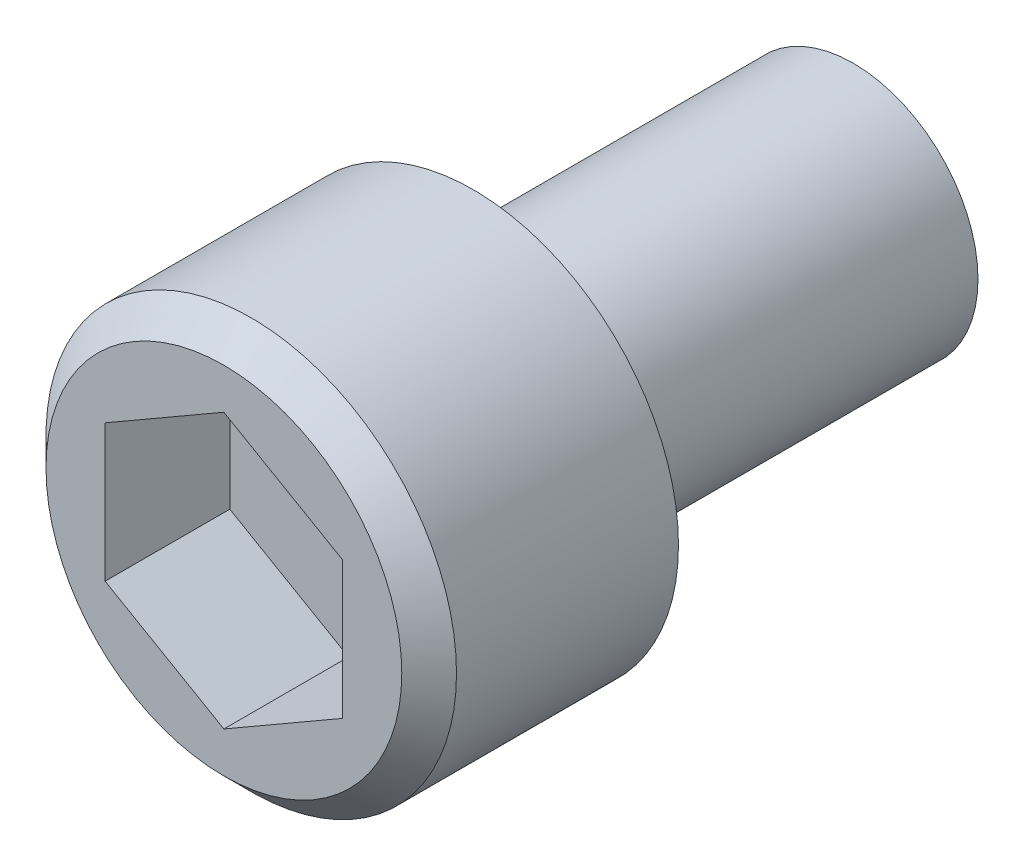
from build123d import *

# Parameters (mm, degrees)
SKETCH1_R     = 2.0828
SHANK_DEPTH   = 6.35
SKETCH2_R     = 3.429
CAP_DEPTH     = 4.1656
FILLET1_R     = 0.3048
HEXCUT_DEPTH  = 2.0828
CHAMFER1_SIZE = 0.4572


with BuildPart() as part:
    # Sketch1 → Shank (new body)
    with BuildSketch(Plane.XY):
        Circle(SKETCH1_R)
    extrude(amount=SHANK_DEPTH)

    # Sketch2 → Cap (add)
    with BuildSketch(Plane.XY.offset(6.35)):
        Circle(SKETCH2_R)
    extrude(amount=CAP_DEPTH)

    # Fillet1
    fillet1_edges = [part.edges().sort_by_distance(p)[0] for p in [
        (-2.0828, 0, 6.35),
    ]]
    fillet(fillet1_edges, radius=FILLET1_R)

    # Sketch3 → HexCut (cut)
    with BuildSketch(Plane(origin=(4.874850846, 0.925692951, 10.5156), x_dir=(1, 0, 0), z_dir=(0, 0, 1))):
        Polygon((-4.874850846, 1.36566593), (-2.890475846, 0.219986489), (-2.890475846, -2.071372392), (-4.874850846, -3.217051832), (-6.859225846, -2.071372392), (-6.859225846, 0.219986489), align=None)
    extrude(amount=-HEXCUT_DEPTH, mode=Mode.SUBTRACT)

    # Chamfer1
    chamfer1_edges = [part.edges().sort_by_distance(p)[0] for p in [
        (-3.429, 0, 10.5156),
    ]]
    chamfer(chamfer1_edges, length=CHAMFER1_SIZE)


solid = part.part
